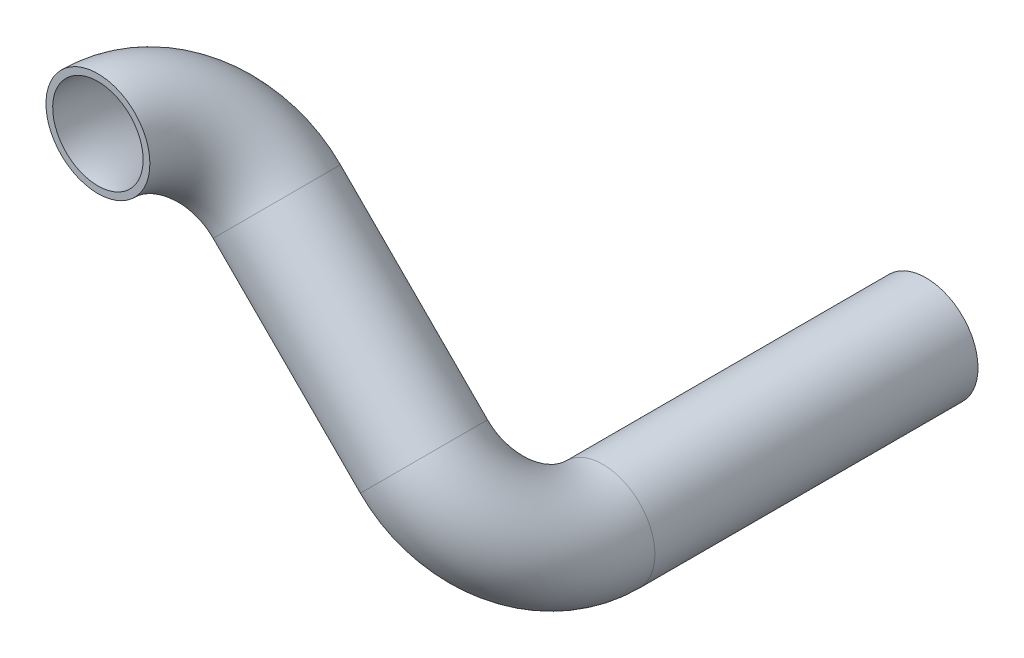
ISO-10303-21;
HEADER;
FILE_DESCRIPTION(('STEP AP214'),'2;1');
FILE_NAME('part.step','',(''),(''),'','','');
FILE_SCHEMA(('AUTOMOTIVE_DESIGN { 1 0 10303 214 1 1 1 1 }'));
ENDSEC;
DATA;
#1=APPLICATION_CONTEXT('core data for automotive mechanical design processes');
#2=APPLICATION_PROTOCOL_DEFINITION('international standard','automotive_design',2000,#1);
#3=PRODUCT_CONTEXT('',#1,'mechanical');
#4=PRODUCT('Part','Part','',(#3));
#5=PRODUCT_RELATED_PRODUCT_CATEGORY('part','',(#4));
#6=PRODUCT_DEFINITION_FORMATION('','',#4);
#7=PRODUCT_DEFINITION_CONTEXT('part definition',#1,'design');
#8=PRODUCT_DEFINITION('design','',#6,#7);
#9=PRODUCT_DEFINITION_SHAPE('','',#8);
#10=(LENGTH_UNIT() NAMED_UNIT(*) SI_UNIT(.MILLI.,.METRE.));
#11=(NAMED_UNIT(*) PLANE_ANGLE_UNIT() SI_UNIT($,.RADIAN.));
#12=(NAMED_UNIT(*) SI_UNIT($,.STERADIAN.) SOLID_ANGLE_UNIT());
#13=UNCERTAINTY_MEASURE_WITH_UNIT(LENGTH_MEASURE(1.E-05),#10,'distance_accuracy_value','');
#14=(GEOMETRIC_REPRESENTATION_CONTEXT(3) GLOBAL_UNCERTAINTY_ASSIGNED_CONTEXT((#13)) GLOBAL_UNIT_ASSIGNED_CONTEXT((#10,
#11,#12)) REPRESENTATION_CONTEXT('',''));
#15=CARTESIAN_POINT('',(0.,0.,0.));
#16=DIRECTION('',(0.,0.,1.));
#17=DIRECTION('',(1.,0.,0.));
#18=AXIS2_PLACEMENT_3D('',#15,#16,#17);
#19=CARTESIAN_POINT('',(0.,0.,0.));
#20=DIRECTION('',(0.,0.,1.));
#21=DIRECTION('',(1.,0.,0.));
#22=AXIS2_PLACEMENT_3D('',#19,#20,#21);
#23=PLANE('',#22);
#24=CARTESIAN_POINT('',(0.,0.,0.));
#25=DIRECTION('',(0.,0.,1.));
#26=DIRECTION('',(1.,0.,0.));
#27=AXIS2_PLACEMENT_3D('',#24,#25,#26);
#28=CIRCLE('',#27,30.226);
#29=CARTESIAN_POINT('',(30.226,0.,0.));
#30=VERTEX_POINT('',#29);
#31=EDGE_CURVE('E33',#30,#30,#28,.T.);
#32=ORIENTED_EDGE('',*,*,#31,.F.);
#33=EDGE_LOOP('',(#32));
#34=FACE_BOUND('',#33,.T.);
#35=CARTESIAN_POINT('',(0.,0.,0.));
#36=DIRECTION('',(0.,0.,1.));
#37=DIRECTION('',(1.,0.,0.));
#38=AXIS2_PLACEMENT_3D('',#35,#36,#37);
#39=CIRCLE('',#38,26.3144);
#40=CARTESIAN_POINT('',(26.3144,0.,0.));
#41=VERTEX_POINT('',#40);
#42=EDGE_CURVE('E40',#41,#41,#39,.T.);
#43=ORIENTED_EDGE('',*,*,#42,.T.);
#44=EDGE_LOOP('',(#43));
#45=FACE_BOUND('',#44,.T.);
#46=ADVANCED_FACE('F29',(#34,#45),#23,.F.);
#47=CARTESIAN_POINT('',(0.,0.,187.947115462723));
#48=DIRECTION('',(0.,0.,-1.));
#49=DIRECTION('',(-1.,0.,0.));
#50=AXIS2_PLACEMENT_3D('',#47,#48,#49);
#51=CYLINDRICAL_SURFACE('',#50,30.226);
#52=CARTESIAN_POINT('',(0.,0.,187.947115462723));
#53=DIRECTION('',(0.,0.,1.));
#54=DIRECTION('',(1.,0.,0.));
#55=AXIS2_PLACEMENT_3D('',#52,#53,#54);
#56=CIRCLE('',#55,30.226);
#57=CARTESIAN_POINT('',(21.3730095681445,-21.3730095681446,187.947115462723));
#58=VERTEX_POINT('',#57);
#59=EDGE_CURVE('E10',#58,#58,#56,.T.);
#60=ORIENTED_EDGE('',*,*,#59,.F.);
#61=EDGE_LOOP('',(#60));
#62=FACE_BOUND('',#61,.T.);
#63=ORIENTED_EDGE('',*,*,#31,.T.);
#64=EDGE_LOOP('',(#63));
#65=FACE_BOUND('',#64,.T.);
#66=ADVANCED_FACE('F31',(#62,#65),#51,.T.);
#67=CARTESIAN_POINT('',(0.,0.,187.947115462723));
#68=DIRECTION('',(0.,0.,-1.));
#69=DIRECTION('',(-1.,0.,0.));
#70=AXIS2_PLACEMENT_3D('',#67,#68,#69);
#71=CYLINDRICAL_SURFACE('',#70,26.3144);
#72=CARTESIAN_POINT('',(0.,0.,187.947115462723));
#73=DIRECTION('',(0.,0.,1.));
#74=DIRECTION('',(1.,0.,0.));
#75=AXIS2_PLACEMENT_3D('',#72,#73,#74);
#76=CIRCLE('',#75,26.3144);
#77=CARTESIAN_POINT('',(18.6070906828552,-18.6070906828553,187.947115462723));
#78=VERTEX_POINT('',#77);
#79=EDGE_CURVE('E47',#78,#78,#76,.T.);
#80=ORIENTED_EDGE('',*,*,#79,.T.);
#81=EDGE_LOOP('',(#80));
#82=FACE_BOUND('',#81,.T.);
#83=ORIENTED_EDGE('',*,*,#42,.F.);
#84=EDGE_LOOP('',(#83));
#85=FACE_BOUND('',#84,.T.);
#86=ADVANCED_FACE('F91',(#82,#85),#71,.F.);
#87=CARTESIAN_POINT('',(-43.1052293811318,43.105229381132,187.947115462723));
#88=DIRECTION('',(0.707106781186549,0.707106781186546,0.));
#89=DIRECTION('',(-0.707106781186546,0.707106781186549,0.));
#90=AXIS2_PLACEMENT_3D('',#87,#88,#89);
#91=TOROIDAL_SURFACE('',#90,60.96,26.3144);
#92=CARTESIAN_POINT('',(-43.1052293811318,43.105229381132,248.907115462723));
#93=DIRECTION('',(-0.707106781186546,0.707106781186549,0.));
#94=DIRECTION('',(-0.707106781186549,-0.707106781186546,0.));
#95=AXIS2_PLACEMENT_3D('',#92,#93,#94);
#96=CIRCLE('',#95,26.3144);
#97=CARTESIAN_POINT('',(-43.1052293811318,43.105229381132,275.221515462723));
#98=VERTEX_POINT('',#97);
#99=EDGE_CURVE('E53',#98,#98,#96,.T.);
#100=CARTESIAN_POINT('',(-43.1052293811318,43.105229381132,187.947115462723));
#101=DIRECTION('',(0.707106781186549,0.707106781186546,0.));
#102=DIRECTION('',(-0.707106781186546,0.707106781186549,0.));
#103=AXIS2_PLACEMENT_3D('',#100,#101,#102);
#104=CIRCLE('',#103,87.2744);
#105=EDGE_CURVE('',#98,#78,#104,.T.);
#106=ORIENTED_EDGE('',*,*,#99,.T.);
#107=ORIENTED_EDGE('',*,*,#79,.F.);
#108=ORIENTED_EDGE('',*,*,#105,.T.);
#109=ORIENTED_EDGE('',*,*,#105,.F.);
#110=EDGE_LOOP('',(#106,#108,#107,#109));
#111=FACE_BOUND('',#110,.T.);
#112=ADVANCED_FACE('F98',(#111),#91,.F.);
#113=CARTESIAN_POINT('',(-43.1052293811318,43.105229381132,187.947115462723));
#114=DIRECTION('',(0.707106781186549,0.707106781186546,0.));
#115=DIRECTION('',(-0.707106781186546,0.707106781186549,0.));
#116=AXIS2_PLACEMENT_3D('',#113,#114,#115);
#117=TOROIDAL_SURFACE('',#116,60.96,30.226);
#118=CARTESIAN_POINT('',(-43.1052293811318,43.105229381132,248.907115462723));
#119=DIRECTION('',(-0.707106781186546,0.707106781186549,0.));
#120=DIRECTION('',(0.500000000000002,0.5,0.707106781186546));
#121=AXIS2_PLACEMENT_3D('',#118,#119,#120);
#122=CIRCLE('',#121,30.226);
#123=CARTESIAN_POINT('',(-43.1052293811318,43.105229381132,279.133115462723));
#124=VERTEX_POINT('',#123);
#125=EDGE_CURVE('E44',#124,#124,#122,.T.);
#126=CARTESIAN_POINT('',(-43.1052293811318,43.105229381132,187.947115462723));
#127=DIRECTION('',(0.707106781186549,0.707106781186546,0.));
#128=DIRECTION('',(-0.707106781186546,0.707106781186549,0.));
#129=AXIS2_PLACEMENT_3D('',#126,#127,#128);
#130=CIRCLE('',#129,91.186);
#131=EDGE_CURVE('',#124,#58,#130,.T.);
#132=ORIENTED_EDGE('',*,*,#125,.F.);
#133=ORIENTED_EDGE('',*,*,#59,.T.);
#134=ORIENTED_EDGE('',*,*,#131,.T.);
#135=ORIENTED_EDGE('',*,*,#131,.F.);
#136=EDGE_LOOP('',(#132,#134,#133,#135));
#137=FACE_BOUND('',#136,.T.);
#138=ADVANCED_FACE('F100',(#137),#117,.T.);
#139=CARTESIAN_POINT('',(-128.723552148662,128.723552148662,248.907115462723));
#140=DIRECTION('',(0.707106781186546,-0.707106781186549,0.));
#141=DIRECTION('',(0.707106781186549,0.707106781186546,0.));
#142=AXIS2_PLACEMENT_3D('',#139,#140,#141);
#143=CYLINDRICAL_SURFACE('',#142,30.226);
#144=CARTESIAN_POINT('',(-128.723552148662,128.723552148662,248.907115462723));
#145=DIRECTION('',(-0.707106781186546,0.707106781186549,0.));
#146=DIRECTION('',(-0.707106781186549,-0.707106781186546,0.));
#147=AXIS2_PLACEMENT_3D('',#144,#145,#146);
#148=CIRCLE('',#147,30.226);
#149=CARTESIAN_POINT('',(-128.723552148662,128.723552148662,218.681115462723));
#150=VERTEX_POINT('',#149);
#151=EDGE_CURVE('E50',#150,#150,#148,.T.);
#152=ORIENTED_EDGE('',*,*,#151,.F.);
#153=EDGE_LOOP('',(#152));
#154=FACE_BOUND('',#153,.T.);
#155=ORIENTED_EDGE('',*,*,#125,.T.);
#156=EDGE_LOOP('',(#155));
#157=FACE_BOUND('',#156,.T.);
#158=ADVANCED_FACE('F81',(#154,#157),#143,.T.);
#159=CARTESIAN_POINT('',(-128.723552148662,128.723552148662,248.907115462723));
#160=DIRECTION('',(0.707106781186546,-0.707106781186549,0.));
#161=DIRECTION('',(0.707106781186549,0.707106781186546,0.));
#162=AXIS2_PLACEMENT_3D('',#159,#160,#161);
#163=CYLINDRICAL_SURFACE('',#162,26.3144);
#164=CARTESIAN_POINT('',(-128.723552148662,128.723552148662,248.907115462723));
#165=DIRECTION('',(-0.707106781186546,0.707106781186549,0.));
#166=DIRECTION('',(-0.707106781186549,-0.707106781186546,0.));
#167=AXIS2_PLACEMENT_3D('',#164,#165,#166);
#168=CIRCLE('',#167,26.3144);
#169=CARTESIAN_POINT('',(-128.723552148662,128.723552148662,222.592715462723));
#170=VERTEX_POINT('',#169);
#171=EDGE_CURVE('E62',#170,#170,#168,.T.);
#172=ORIENTED_EDGE('',*,*,#171,.T.);
#173=EDGE_LOOP('',(#172));
#174=FACE_BOUND('',#173,.T.);
#175=ORIENTED_EDGE('',*,*,#99,.F.);
#176=EDGE_LOOP('',(#175));
#177=FACE_BOUND('',#176,.T.);
#178=ADVANCED_FACE('F66',(#174,#177),#163,.F.);
#179=CARTESIAN_POINT('',(-128.723552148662,128.723552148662,309.867115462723));
#180=DIRECTION('',(-0.707106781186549,-0.707106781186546,0.));
#181=DIRECTION('',(0.707106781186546,-0.707106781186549,0.));
#182=AXIS2_PLACEMENT_3D('',#179,#180,#181);
#183=TOROIDAL_SURFACE('',#182,60.9600000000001,26.3144);
#184=CARTESIAN_POINT('',(-171.828781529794,171.828781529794,309.867115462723));
#185=DIRECTION('',(0.,0.,1.));
#186=DIRECTION('',(-0.707106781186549,-0.707106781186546,0.));
#187=AXIS2_PLACEMENT_3D('',#184,#185,#186);
#188=CIRCLE('',#187,26.3144);
#189=CARTESIAN_POINT('',(-190.435872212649,190.43587221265,309.867115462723));
#190=VERTEX_POINT('',#189);
#191=EDGE_CURVE('E59',#190,#190,#188,.T.);
#192=CARTESIAN_POINT('',(-128.723552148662,128.723552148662,309.867115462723));
#193=DIRECTION('',(-0.707106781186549,-0.707106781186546,0.));
#194=DIRECTION('',(0.707106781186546,-0.707106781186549,0.));
#195=AXIS2_PLACEMENT_3D('',#192,#193,#194);
#196=CIRCLE('',#195,87.2744000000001);
#197=EDGE_CURVE('',#190,#170,#196,.T.);
#198=ORIENTED_EDGE('',*,*,#191,.T.);
#199=ORIENTED_EDGE('',*,*,#171,.F.);
#200=ORIENTED_EDGE('',*,*,#197,.T.);
#201=ORIENTED_EDGE('',*,*,#197,.F.);
#202=EDGE_LOOP('',(#198,#200,#199,#201));
#203=FACE_BOUND('',#202,.T.);
#204=ADVANCED_FACE('F69',(#203),#183,.F.);
#205=CARTESIAN_POINT('',(-128.723552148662,128.723552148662,309.867115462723));
#206=DIRECTION('',(-0.707106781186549,-0.707106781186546,0.));
#207=DIRECTION('',(0.707106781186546,-0.707106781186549,0.));
#208=AXIS2_PLACEMENT_3D('',#205,#206,#207);
#209=TOROIDAL_SURFACE('',#208,60.9600000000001,30.226);
#210=CARTESIAN_POINT('',(-171.828781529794,171.828781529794,309.867115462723));
#211=DIRECTION('',(0.,0.,1.));
#212=DIRECTION('',(-0.707106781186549,-0.707106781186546,0.));
#213=AXIS2_PLACEMENT_3D('',#210,#211,#212);
#214=CIRCLE('',#213,30.226);
#215=CARTESIAN_POINT('',(-193.201791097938,193.201791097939,309.867115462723));
#216=VERTEX_POINT('',#215);
#217=EDGE_CURVE('E56',#216,#216,#214,.T.);
#218=CARTESIAN_POINT('',(-128.723552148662,128.723552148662,309.867115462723));
#219=DIRECTION('',(-0.707106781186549,-0.707106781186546,0.));
#220=DIRECTION('',(0.707106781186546,-0.707106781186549,0.));
#221=AXIS2_PLACEMENT_3D('',#218,#219,#220);
#222=CIRCLE('',#221,91.186);
#223=EDGE_CURVE('',#216,#150,#222,.T.);
#224=ORIENTED_EDGE('',*,*,#217,.F.);
#225=ORIENTED_EDGE('',*,*,#151,.T.);
#226=ORIENTED_EDGE('',*,*,#223,.T.);
#227=ORIENTED_EDGE('',*,*,#223,.F.);
#228=EDGE_LOOP('',(#224,#226,#225,#227));
#229=FACE_BOUND('',#228,.T.);
#230=ADVANCED_FACE('F71',(#229),#209,.T.);
#231=CARTESIAN_POINT('',(-171.828781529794,171.828781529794,309.867115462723));
#232=DIRECTION('',(0.,0.,1.));
#233=DIRECTION('',(-0.707106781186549,-0.707106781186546,0.));
#234=AXIS2_PLACEMENT_3D('',#231,#232,#233);
#235=PLANE('',#234);
#236=ORIENTED_EDGE('',*,*,#191,.F.);
#237=EDGE_LOOP('',(#236));
#238=FACE_BOUND('',#237,.T.);
#239=ORIENTED_EDGE('',*,*,#217,.T.);
#240=EDGE_LOOP('',(#239));
#241=FACE_BOUND('',#240,.T.);
#242=ADVANCED_FACE('F74',(#238,#241),#235,.T.);
#243=CLOSED_SHELL('',(#46,#66,#86,#112,#138,#158,#178,#204,#230,#242));
#244=MANIFOLD_SOLID_BREP('B2',#243);
#245=ADVANCED_BREP_SHAPE_REPRESENTATION('',(#18,#244),#14);
#246=SHAPE_DEFINITION_REPRESENTATION(#9,#245);
ENDSEC;
END-ISO-10303-21;
